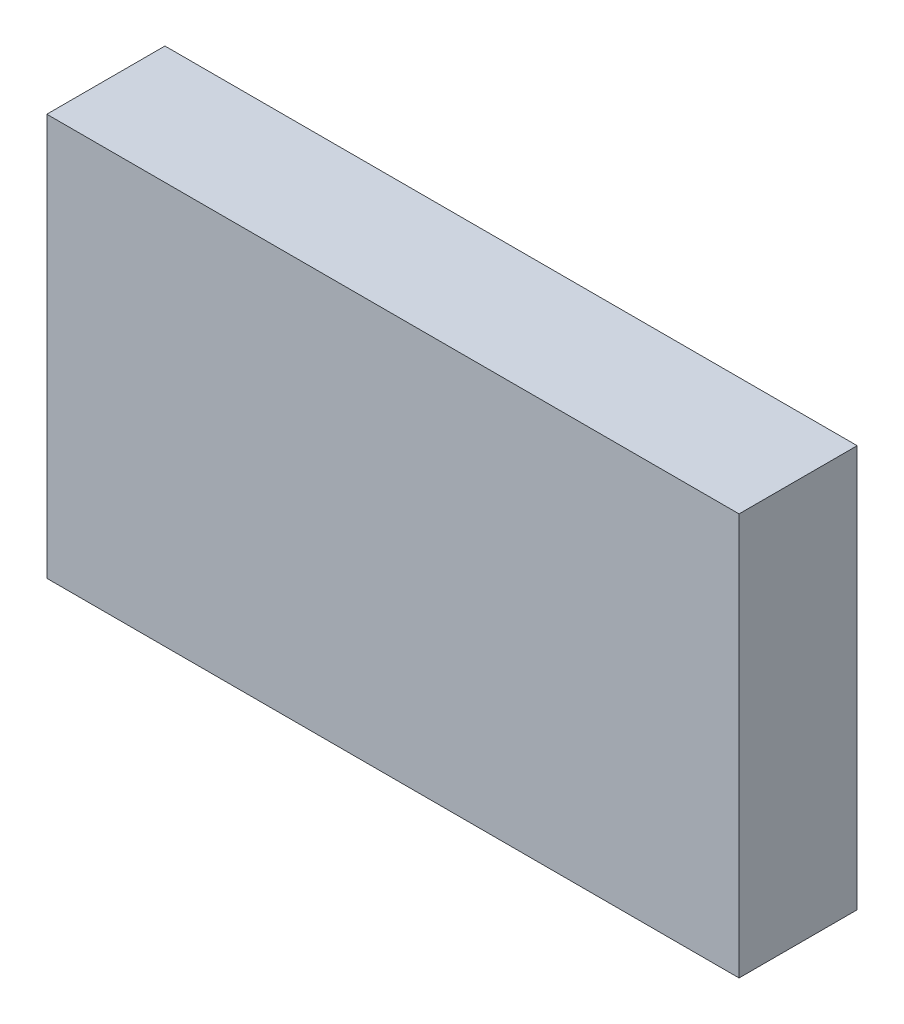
from build123d import *

# Parameters (mm, degrees)
GENERAL_W           = 14.8844
GENERAL_H           = 8.642204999
BOSS_EXTRUDE1_DEPTH = 2.54


with BuildPart() as part:
    # GENERAL → Boss-Extrude1 (new body)
    with BuildSketch(Plane.XY):
        with Locations((-0.3175, 0.117402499)):
            Rectangle(GENERAL_W, GENERAL_H)
    extrude(amount=BOSS_EXTRUDE1_DEPTH)


solid = part.part
